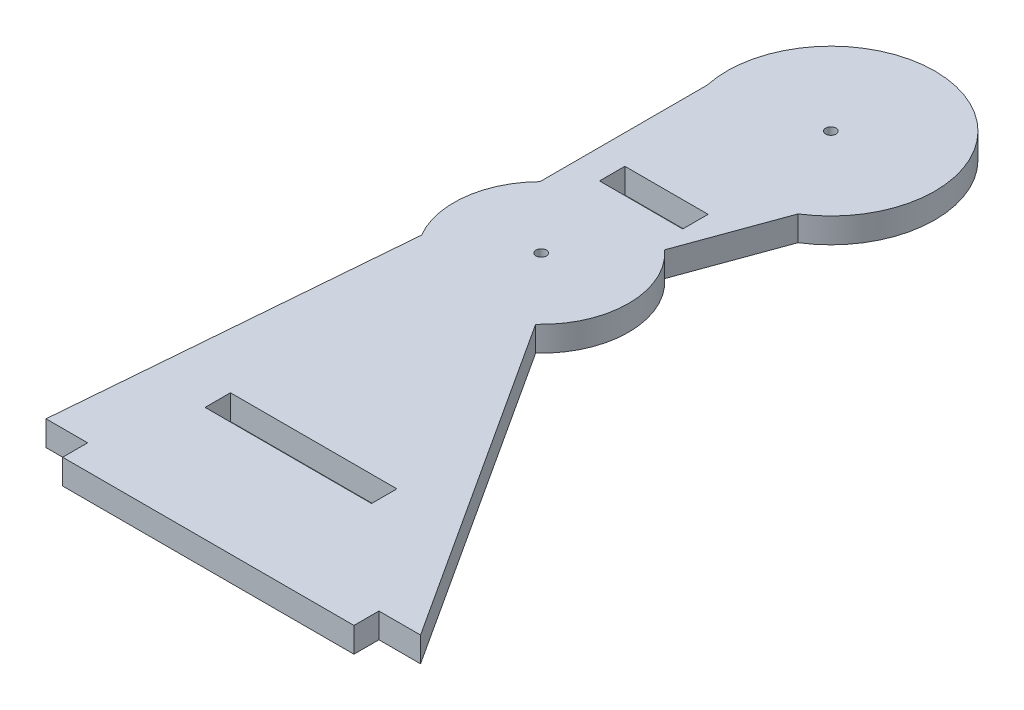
from build123d import *

# Parameters (mm, degrees)
IZIM1_R                     = 1.25
IZIM1_W                     = 40
IZIM1_H                     = 6.1
IZIM1_W_2                   = 20
Y_KSEKLIK_EKSTR_ZYON1_DEPTH = 6


with BuildPart() as part:
    # izim1 → Y_kseklik-Ekstr_zyon1 (new body)
    with BuildSketch(Plane(origin=(0, 0, 0), x_dir=(1, 0, 0), z_dir=(0, 1, 0))):
        with BuildLine():
            Line((0, 0), (0, 6))
            Line((0, 6), (10, 6))
            Line((10, 6), (-40.83505489, 84.49663488))
            ThreePointArc((-40.83505489, 84.49663488), (-34, 100), (-40.83505489, 115.50336512))
            Line((-40.83505489, 115.50336512), (-32.284551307, 138.99568064))
            ThreePointArc((-32.284551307, 138.99568064), (-35.880749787, 183.217528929), (-70, 154.85591271))
            Line((-70, 154.85591271), (-70, 114.696938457))
            ThreePointArc((-70, 114.696938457), (-75.844589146, 102.550118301), (-73.100618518, 89.352577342))
            Line((-73.100618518, 89.352577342), (-80, 6))
            Line((-80, 6), (-70, 6))
            Line((-70, 6), (-70, 0))
            Line((-70, 0), (0, 0))
        make_face()
        with Locations(Location((-55, 100, 0), (0, 0, 270))):
            Circle(IZIM1_R, mode=Mode.SUBTRACT)
        with Locations(Location((-45.571815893, 160.172285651, 0), (0, 0, 270))):
            Circle(IZIM1_R, mode=Mode.SUBTRACT)
        with Locations((-43.259259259, 30.531481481)):
            Rectangle(IZIM1_W, IZIM1_H, mode=Mode.SUBTRACT)
        with Locations((-53, 125.05)):
            Rectangle(IZIM1_W_2, IZIM1_H, mode=Mode.SUBTRACT)
    extrude(amount=Y_KSEKLIK_EKSTR_ZYON1_DEPTH)


solid = part.part
